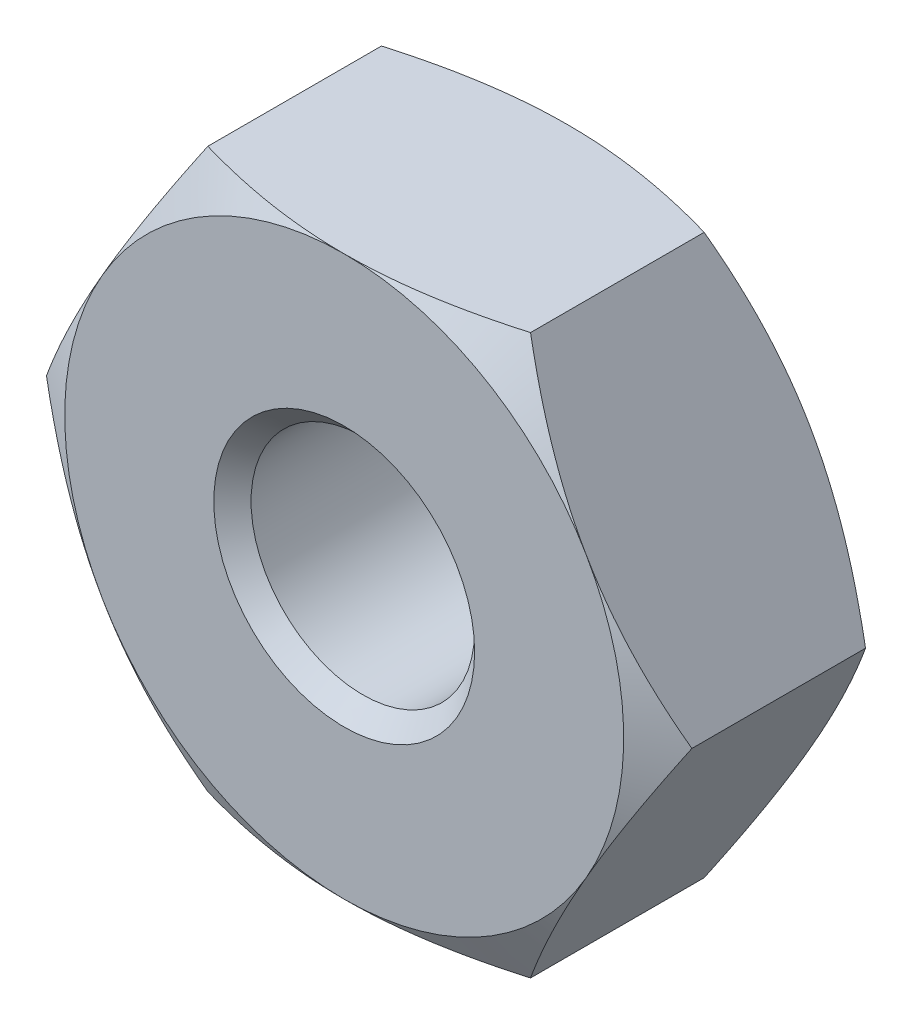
ISO-10303-21;
HEADER;
FILE_DESCRIPTION(('STEP AP214'),'2;1');
FILE_NAME('part.step','',(''),(''),'','','');
FILE_SCHEMA(('AUTOMOTIVE_DESIGN { 1 0 10303 214 1 1 1 1 }'));
ENDSEC;
DATA;
#1=APPLICATION_CONTEXT('core data for automotive mechanical design processes');
#2=APPLICATION_PROTOCOL_DEFINITION('international standard','automotive_design',2000,#1);
#3=PRODUCT_CONTEXT('',#1,'mechanical');
#4=PRODUCT('Part','Part','',(#3));
#5=PRODUCT_RELATED_PRODUCT_CATEGORY('part','',(#4));
#6=PRODUCT_DEFINITION_FORMATION('','',#4);
#7=PRODUCT_DEFINITION_CONTEXT('part definition',#1,'design');
#8=PRODUCT_DEFINITION('design','',#6,#7);
#9=PRODUCT_DEFINITION_SHAPE('','',#8);
#10=(LENGTH_UNIT() NAMED_UNIT(*) SI_UNIT(.MILLI.,.METRE.));
#11=(NAMED_UNIT(*) PLANE_ANGLE_UNIT() SI_UNIT($,.RADIAN.));
#12=(NAMED_UNIT(*) SI_UNIT($,.STERADIAN.) SOLID_ANGLE_UNIT());
#13=UNCERTAINTY_MEASURE_WITH_UNIT(LENGTH_MEASURE(1.E-05),#10,'distance_accuracy_value','');
#14=(GEOMETRIC_REPRESENTATION_CONTEXT(3) GLOBAL_UNCERTAINTY_ASSIGNED_CONTEXT((#13)) GLOBAL_UNIT_ASSIGNED_CONTEXT((#10,
#11,#12)) REPRESENTATION_CONTEXT('',''));
#15=CARTESIAN_POINT('',(0.,0.,0.));
#16=DIRECTION('',(0.,0.,1.));
#17=DIRECTION('',(1.,0.,0.));
#18=AXIS2_PLACEMENT_3D('',#15,#16,#17);
#19=CARTESIAN_POINT('',(-0.866025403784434,-1.5,-1.2));
#20=DIRECTION('',(0.,-1.,0.));
#21=DIRECTION('',(0.,0.,-1.));
#22=AXIS2_PLACEMENT_3D('',#19,#20,#21);
#23=PLANE('',#22);
#24=CARTESIAN_POINT('',(-2.29682699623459,-1.5,-0.717790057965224));
#25=CARTESIAN_POINT('',(-2.23096843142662,-1.5,-0.685963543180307));
#26=CARTESIAN_POINT('',(-2.16495427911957,-1.5,-0.654453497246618));
#27=CARTESIAN_POINT('',(-2.03253035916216,-1.5,-0.592246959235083));
#28=CARTESIAN_POINT('',(-1.9661205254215,-1.5,-0.561550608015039));
#29=CARTESIAN_POINT('',(-1.83246206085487,-1.5,-0.500990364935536));
#30=CARTESIAN_POINT('',(-1.76521080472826,-1.5,-0.47113224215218));
#31=CARTESIAN_POINT('',(-1.63015654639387,-1.5,-0.412699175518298));
#32=CARTESIAN_POINT('',(-1.56235357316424,-1.5,-0.384124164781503));
#33=CARTESIAN_POINT('',(-1.42524182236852,-1.5,-0.328255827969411));
#34=CARTESIAN_POINT('',(-1.35592477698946,-1.5,-0.30098253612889));
#35=CARTESIAN_POINT('',(-1.21648682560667,-1.5,-0.248581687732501));
#36=CARTESIAN_POINT('',(-1.14636582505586,-1.5,-0.223454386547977));
#37=CARTESIAN_POINT('',(-0.934888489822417,-1.5,-0.152281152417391));
#38=CARTESIAN_POINT('',(-0.792055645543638,-1.5,-0.110289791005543));
#39=CARTESIAN_POINT('',(-0.574716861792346,-1.5,-0.0606014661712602));
#40=CARTESIAN_POINT('',(-0.501740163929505,-1.5,-0.0462535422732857));
#41=CARTESIAN_POINT('',(-0.354902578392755,-1.5,-0.0229763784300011));
#42=CARTESIAN_POINT('',(-0.281041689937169,-1.5,-0.0140471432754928));
#43=CARTESIAN_POINT('',(-0.133293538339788,-1.5,-0.00239409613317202));
#44=CARTESIAN_POINT('',(-0.0594094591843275,-1.5,0.000369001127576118));
#45=CARTESIAN_POINT('',(0.0882997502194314,-1.5,-0.000449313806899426));
#46=CARTESIAN_POINT('',(0.162124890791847,-1.5,-0.00402907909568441));
#47=CARTESIAN_POINT('',(0.340722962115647,-1.5,-0.0200432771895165));
#48=CARTESIAN_POINT('',(0.445215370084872,-1.5,-0.035612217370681));
#49=CARTESIAN_POINT('',(0.652266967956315,-1.5,-0.0766496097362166));
#50=CARTESIAN_POINT('',(0.754823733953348,-1.5,-0.102129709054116));
#51=CARTESIAN_POINT('',(0.908315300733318,-1.5,-0.146069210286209));
#52=CARTESIAN_POINT('',(0.960034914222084,-1.5,-0.161892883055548));
#53=CARTESIAN_POINT('',(1.06293144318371,-1.5,-0.195106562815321));
#54=CARTESIAN_POINT('',(1.11410870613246,-1.5,-0.212495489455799));
#55=CARTESIAN_POINT('',(1.21571016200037,-1.5,-0.248477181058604));
#56=CARTESIAN_POINT('',(1.2661369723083,-1.5,-0.267062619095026));
#57=CARTESIAN_POINT('',(1.36659934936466,-1.5,-0.305324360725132));
#58=CARTESIAN_POINT('',(1.416634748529,-1.5,-0.325001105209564));
#59=CARTESIAN_POINT('',(1.4664888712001,-1.5,-0.345115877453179));
#60=B_SPLINE_CURVE_WITH_KNOTS('',3,(#24,#25,#26,#27,#28,#29,#30,#31,#32,#33,#34,#35,#36,#37,#38,
#39,#40,#41,#42,#43,#44,#45,#46,#47,#48,#49,#50,#51,#52,#53,#54,#55,#56,#57,#58,#59),
.UNSPECIFIED.,.F.,.F.,(4,2,2,2,2,2,2,2,2,2,2,2,2,2,2,2,2,4),(0.,0.219439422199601,
0.438916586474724,0.659649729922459,0.880371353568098,1.10380188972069,1.3272589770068,
1.77299403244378,1.99595442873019,2.21891502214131,2.4404509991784,2.66192946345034,
2.97821851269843,3.29488037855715,3.45711959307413,3.61924767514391,3.78046319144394,
3.94174432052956),.UNSPECIFIED.);
#61=CARTESIAN_POINT('',(-0.866025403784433,-1.5,-0.133974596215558));
#62=VERTEX_POINT('',#61);
#63=CARTESIAN_POINT('',(0.,-1.5,0.));
#64=VERTEX_POINT('',#63);
#65=EDGE_CURVE('E51',#62,#64,#60,.T.);
#66=ORIENTED_EDGE('',*,*,#65,.F.);
#67=DIRECTION('',(0.,0.,1.));
#68=VECTOR('',#67,1.);
#69=CARTESIAN_POINT('',(-0.866025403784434,-1.5,-1.2));
#70=LINE('',#69,#68);
#71=CARTESIAN_POINT('',(-0.866025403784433,-1.5,-1.06602540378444));
#72=VERTEX_POINT('',#71);
#73=EDGE_CURVE('E164',#72,#62,#70,.T.);
#74=ORIENTED_EDGE('',*,*,#73,.F.);
#75=CARTESIAN_POINT('',(-2.29682699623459,-1.5,-0.482209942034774));
#76=CARTESIAN_POINT('',(-2.23096843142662,-1.5,-0.514036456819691));
#77=CARTESIAN_POINT('',(-2.16495427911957,-1.5,-0.54554650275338));
#78=CARTESIAN_POINT('',(-2.03253035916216,-1.5,-0.607753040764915));
#79=CARTESIAN_POINT('',(-1.9661205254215,-1.5,-0.63844939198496));
#80=CARTESIAN_POINT('',(-1.83246206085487,-1.5,-0.699009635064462));
#81=CARTESIAN_POINT('',(-1.76521080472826,-1.5,-0.728867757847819));
#82=CARTESIAN_POINT('',(-1.63015654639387,-1.5,-0.787300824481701));
#83=CARTESIAN_POINT('',(-1.56235357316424,-1.5,-0.815875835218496));
#84=CARTESIAN_POINT('',(-1.42524182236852,-1.5,-0.871744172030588));
#85=CARTESIAN_POINT('',(-1.35592477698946,-1.5,-0.899017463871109));
#86=CARTESIAN_POINT('',(-1.21648682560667,-1.5,-0.951418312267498));
#87=CARTESIAN_POINT('',(-1.14636582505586,-1.5,-0.976545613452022));
#88=CARTESIAN_POINT('',(-0.934888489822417,-1.5,-1.04771884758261));
#89=CARTESIAN_POINT('',(-0.792055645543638,-1.5,-1.08971020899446));
#90=CARTESIAN_POINT('',(-0.574716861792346,-1.5,-1.13939853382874));
#91=CARTESIAN_POINT('',(-0.501740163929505,-1.5,-1.15374645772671));
#92=CARTESIAN_POINT('',(-0.354902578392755,-1.5,-1.17702362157));
#93=CARTESIAN_POINT('',(-0.281041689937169,-1.5,-1.18595285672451));
#94=CARTESIAN_POINT('',(-0.133293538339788,-1.5,-1.19760590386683));
#95=CARTESIAN_POINT('',(-0.0594094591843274,-1.5,-1.20036900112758));
#96=CARTESIAN_POINT('',(0.0882997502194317,-1.5,-1.1995506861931));
#97=CARTESIAN_POINT('',(0.162124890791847,-1.5,-1.19597092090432));
#98=CARTESIAN_POINT('',(0.340722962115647,-1.5,-1.17995672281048));
#99=CARTESIAN_POINT('',(0.445215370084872,-1.5,-1.16438778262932));
#100=CARTESIAN_POINT('',(0.652266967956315,-1.5,-1.12335039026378));
#101=CARTESIAN_POINT('',(0.754823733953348,-1.5,-1.09787029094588));
#102=CARTESIAN_POINT('',(0.908315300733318,-1.5,-1.05393078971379));
#103=CARTESIAN_POINT('',(0.960034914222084,-1.5,-1.03810711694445));
#104=CARTESIAN_POINT('',(1.06293144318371,-1.5,-1.00489343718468));
#105=CARTESIAN_POINT('',(1.11410870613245,-1.5,-0.987504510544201));
#106=CARTESIAN_POINT('',(1.21571016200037,-1.5,-0.951522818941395));
#107=CARTESIAN_POINT('',(1.26613697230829,-1.5,-0.932937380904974));
#108=CARTESIAN_POINT('',(1.36659934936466,-1.5,-0.894675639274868));
#109=CARTESIAN_POINT('',(1.416634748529,-1.5,-0.874998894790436));
#110=CARTESIAN_POINT('',(1.46648887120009,-1.5,-0.854884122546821));
#111=B_SPLINE_CURVE_WITH_KNOTS('',3,(#75,#76,#77,#78,#79,#80,#81,#82,#83,#84,#85,#86,#87,#88,
#89,#90,#91,#92,#93,#94,#95,#96,#97,#98,#99,#100,#101,#102,#103,#104,#105,#106,#107,#108,#109,
#110),.UNSPECIFIED.,.F.,.F.,(4,2,2,2,2,2,2,2,2,2,2,2,2,2,2,2,2,4),(0.,0.219439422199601,
0.438916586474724,0.659649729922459,0.880371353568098,1.10380188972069,1.3272589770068,
1.77299403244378,1.99595442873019,2.21891502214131,2.4404509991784,2.66192946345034,
2.97821851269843,3.29488037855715,3.45711959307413,3.61924767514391,3.78046319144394,
3.94174432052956),.UNSPECIFIED.);
#112=CARTESIAN_POINT('',(0.,-1.5,-1.2));
#113=VERTEX_POINT('',#112);
#114=EDGE_CURVE('E321',#113,#72,#111,.F.);
#115=ORIENTED_EDGE('',*,*,#114,.F.);
#116=CARTESIAN_POINT('',(0.866025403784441,-1.5,-1.06602540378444));
#117=VERTEX_POINT('',#116);
#118=EDGE_CURVE('E159',#117,#113,#111,.F.);
#119=ORIENTED_EDGE('',*,*,#118,.F.);
#120=DIRECTION('',(0.,0.,1.));
#121=VECTOR('',#120,1.);
#122=CARTESIAN_POINT('',(0.866025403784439,-1.5,-1.2));
#123=LINE('',#122,#121);
#124=CARTESIAN_POINT('',(0.866025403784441,-1.5,-0.133974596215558));
#125=VERTEX_POINT('',#124);
#126=EDGE_CURVE('E154',#117,#125,#123,.T.);
#127=ORIENTED_EDGE('',*,*,#126,.T.);
#128=EDGE_CURVE('E146',#64,#125,#60,.T.);
#129=ORIENTED_EDGE('',*,*,#128,.F.);
#130=EDGE_LOOP('',(#66,#74,#115,#119,#127,#129));
#131=FACE_BOUND('',#130,.T.);
#132=ADVANCED_FACE('F35',(#131),#23,.T.);
#133=CARTESIAN_POINT('',(-1.73205080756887,0.,-1.2));
#134=DIRECTION('',(-0.866025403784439,-0.5,0.));
#135=DIRECTION('',(0.5,-0.866025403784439,0.));
#136=AXIS2_PLACEMENT_3D('',#133,#134,#135);
#137=PLANE('',#136);
#138=CARTESIAN_POINT('',(-1.73216627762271,0.000199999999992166,-0.134041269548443));
#139=CARTESIAN_POINT('',(-1.69410775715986,-0.065719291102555,-0.112057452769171));
#140=CARTESIAN_POINT('',(-1.65572072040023,-0.132207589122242,-0.092063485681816));
#141=CARTESIAN_POINT('',(-1.57828184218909,-0.266335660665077,-0.0571626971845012));
#142=CARTESIAN_POINT('',(-1.53922862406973,-0.333977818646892,-0.0422682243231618));
#143=CARTESIAN_POINT('',(-1.46160621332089,-0.468423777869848,-0.0190812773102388));
#144=CARTESIAN_POINT('',(-1.42304896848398,-0.535206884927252,-0.0106345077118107));
#145=CARTESIAN_POINT('',(-1.34575291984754,-0.669087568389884,-0.000548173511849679));
#146=CARTESIAN_POINT('',(-1.30701439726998,-0.736184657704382,0.00109974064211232));
#147=CARTESIAN_POINT('',(-1.23462040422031,-0.861574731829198,-0.00231621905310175));
#148=CARTESIAN_POINT('',(-1.20095413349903,-0.919886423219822,-0.00654135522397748));
#149=CARTESIAN_POINT('',(-1.13384094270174,-1.03612987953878,-0.0199363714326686));
#150=CARTESIAN_POINT('',(-1.10039425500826,-1.09406124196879,-0.0291108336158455));
#151=CARTESIAN_POINT('',(-1.03314252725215,-1.21054465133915,-0.0520477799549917));
#152=CARTESIAN_POINT('',(-0.999346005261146,-1.26908194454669,-0.0659075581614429));
#153=CARTESIAN_POINT('',(-0.932257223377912,-1.38528312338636,-0.0973643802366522));
#154=CARTESIAN_POINT('',(-0.898964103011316,-1.44294849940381,-0.114954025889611));
#155=CARTESIAN_POINT('',(-0.865909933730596,-1.5002,-0.134041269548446));
#156=B_SPLINE_CURVE_WITH_KNOTS('',3,(#138,#139,#140,#141,#142,#143,#144,#145,#146,#147,#148,
#149,#150,#151,#152,#153,#154,#155),.UNSPECIFIED.,.F.,.F.,(4,2,2,2,2,2,2,2,4),(0.,
0.237777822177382,0.476127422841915,0.708577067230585,0.940741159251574,1.1429435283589,
1.34533342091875,1.55221450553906,1.75868901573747),.UNSPECIFIED.);
#157=CARTESIAN_POINT('',(-1.73205080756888,0.,-0.133974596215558));
#158=VERTEX_POINT('',#157);
#159=CARTESIAN_POINT('',(-1.29903810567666,-0.75,0.));
#160=VERTEX_POINT('',#159);
#161=EDGE_CURVE('E58',#158,#160,#156,.T.);
#162=ORIENTED_EDGE('',*,*,#161,.F.);
#163=DIRECTION('',(0.,0.,1.));
#164=VECTOR('',#163,1.);
#165=CARTESIAN_POINT('',(-1.73205080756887,0.,-1.2));
#166=LINE('',#165,#164);
#167=CARTESIAN_POINT('',(-1.73205080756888,0.,-1.06602540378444));
#168=VERTEX_POINT('',#167);
#169=EDGE_CURVE('E173',#168,#158,#166,.T.);
#170=ORIENTED_EDGE('',*,*,#169,.F.);
#171=CARTESIAN_POINT('',(-0.865909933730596,-1.5002,-1.06595873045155));
#172=CARTESIAN_POINT('',(-0.903968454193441,-1.43428070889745,-1.08794254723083));
#173=CARTESIAN_POINT('',(-0.942355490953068,-1.36779241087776,-1.10793651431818));
#174=CARTESIAN_POINT('',(-1.01979436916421,-1.23366433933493,-1.1428373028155));
#175=CARTESIAN_POINT('',(-1.05884758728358,-1.16602218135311,-1.15773177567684));
#176=CARTESIAN_POINT('',(-1.13646999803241,-1.03157622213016,-1.18091872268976));
#177=CARTESIAN_POINT('',(-1.17502724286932,-0.964793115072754,-1.18936549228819));
#178=CARTESIAN_POINT('',(-1.25232329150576,-0.830912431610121,-1.19945182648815));
#179=CARTESIAN_POINT('',(-1.29106181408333,-0.763815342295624,-1.20109974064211));
#180=CARTESIAN_POINT('',(-1.363455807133,-0.638425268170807,-1.1976837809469));
#181=CARTESIAN_POINT('',(-1.39712207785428,-0.580113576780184,-1.19345864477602));
#182=CARTESIAN_POINT('',(-1.46423526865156,-0.463870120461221,-1.18006362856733));
#183=CARTESIAN_POINT('',(-1.49768195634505,-0.405938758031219,-1.17088916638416));
#184=CARTESIAN_POINT('',(-1.56493368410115,-0.289455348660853,-1.14795222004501));
#185=CARTESIAN_POINT('',(-1.59873020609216,-0.230918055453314,-1.13409244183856));
#186=CARTESIAN_POINT('',(-1.66581898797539,-0.114716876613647,-1.10263561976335));
#187=CARTESIAN_POINT('',(-1.69911210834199,-0.0570515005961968,-1.08504597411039));
#188=CARTESIAN_POINT('',(-1.73216627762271,0.000199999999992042,-1.06595873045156));
#189=B_SPLINE_CURVE_WITH_KNOTS('',3,(#171,#172,#173,#174,#175,#176,#177,#178,#179,#180,#181,
#182,#183,#184,#185,#186,#187,#188),.UNSPECIFIED.,.F.,.F.,(4,2,2,2,2,2,2,2,4),(0.,
0.237777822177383,0.476127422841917,0.708577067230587,0.940741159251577,1.1429435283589,
1.34533342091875,1.55221450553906,1.75868901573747),.UNSPECIFIED.);
#190=CARTESIAN_POINT('',(-1.29903810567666,-0.75,-1.2));
#191=VERTEX_POINT('',#190);
#192=EDGE_CURVE('E203',#191,#168,#189,.T.);
#193=ORIENTED_EDGE('',*,*,#192,.F.);
#194=EDGE_CURVE('E319',#72,#191,#189,.T.);
#195=ORIENTED_EDGE('',*,*,#194,.F.);
#196=ORIENTED_EDGE('',*,*,#73,.T.);
#197=EDGE_CURVE('E284',#160,#62,#156,.T.);
#198=ORIENTED_EDGE('',*,*,#197,.F.);
#199=EDGE_LOOP('',(#162,#170,#193,#195,#196,#198));
#200=FACE_BOUND('',#199,.T.);
#201=ADVANCED_FACE('F296',(#200),#137,.T.);
#202=CARTESIAN_POINT('',(-0.866025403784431,1.49999999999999,-1.2));
#203=DIRECTION('',(-0.866025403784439,0.5,0.));
#204=DIRECTION('',(-0.5,-0.866025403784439,0.));
#205=AXIS2_PLACEMENT_3D('',#202,#203,#204);
#206=PLANE('',#205);
#207=CARTESIAN_POINT('',(-0.865909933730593,1.50019999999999,-0.134041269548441));
#208=CARTESIAN_POINT('',(-0.903968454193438,1.43428070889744,-0.112057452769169));
#209=CARTESIAN_POINT('',(-0.942355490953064,1.36779241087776,-0.0920634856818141));
#210=CARTESIAN_POINT('',(-1.0197943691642,1.23366433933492,-0.0571626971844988));
#211=CARTESIAN_POINT('',(-1.05884758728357,1.16602218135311,-0.0422682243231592));
#212=CARTESIAN_POINT('',(-1.1364699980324,1.03157622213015,-0.0190812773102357));
#213=CARTESIAN_POINT('',(-1.17502724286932,0.964793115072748,-0.0106345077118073));
#214=CARTESIAN_POINT('',(-1.25232329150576,0.830912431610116,-0.000548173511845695));
#215=CARTESIAN_POINT('',(-1.29106181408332,0.763815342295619,0.00109974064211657));
#216=CARTESIAN_POINT('',(-1.36345580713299,0.638425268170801,-0.0023162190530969));
#217=CARTESIAN_POINT('',(-1.39712207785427,0.580113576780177,-0.00654135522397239));
#218=CARTESIAN_POINT('',(-1.46423526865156,0.463870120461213,-0.0199363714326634));
#219=CARTESIAN_POINT('',(-1.49768195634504,0.405938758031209,-0.0291108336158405));
#220=CARTESIAN_POINT('',(-1.56493368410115,0.289455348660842,-0.052047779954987));
#221=CARTESIAN_POINT('',(-1.59873020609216,0.230918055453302,-0.0659075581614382));
#222=CARTESIAN_POINT('',(-1.66581898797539,0.114716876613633,-0.097364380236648));
#223=CARTESIAN_POINT('',(-1.69911210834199,0.0570515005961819,-0.114954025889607));
#224=CARTESIAN_POINT('',(-1.73216627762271,-0.000200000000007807,-0.134041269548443));
#225=B_SPLINE_CURVE_WITH_KNOTS('',3,(#207,#208,#209,#210,#211,#212,#213,#214,#215,#216,#217,
#218,#219,#220,#221,#222,#223,#224),.UNSPECIFIED.,.F.,.F.,(4,2,2,2,2,2,2,2,4),(0.,
0.237777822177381,0.476127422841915,0.708577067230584,0.940741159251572,1.1429435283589,
1.34533342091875,1.55221450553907,1.75868901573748),.UNSPECIFIED.);
#226=CARTESIAN_POINT('',(-0.866025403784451,1.49999999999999,-0.133974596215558));
#227=VERTEX_POINT('',#226);
#228=CARTESIAN_POINT('',(-1.29903810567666,0.75,0.));
#229=VERTEX_POINT('',#228);
#230=EDGE_CURVE('E329',#227,#229,#225,.T.);
#231=ORIENTED_EDGE('',*,*,#230,.F.);
#232=DIRECTION('',(0.,0.,1.));
#233=VECTOR('',#232,1.);
#234=CARTESIAN_POINT('',(-0.866025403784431,1.49999999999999,-1.2));
#235=LINE('',#234,#233);
#236=CARTESIAN_POINT('',(-0.866025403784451,1.49999999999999,-1.06602540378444));
#237=VERTEX_POINT('',#236);
#238=EDGE_CURVE('E156',#237,#227,#235,.T.);
#239=ORIENTED_EDGE('',*,*,#238,.F.);
#240=CARTESIAN_POINT('',(-1.73216627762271,-0.00020000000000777,-1.06595873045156));
#241=CARTESIAN_POINT('',(-1.69410775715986,0.0657192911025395,-1.08794254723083));
#242=CARTESIAN_POINT('',(-1.65572072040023,0.132207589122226,-1.10793651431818));
#243=CARTESIAN_POINT('',(-1.57828184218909,0.266335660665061,-1.1428373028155));
#244=CARTESIAN_POINT('',(-1.53922862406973,0.333977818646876,-1.15773177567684));
#245=CARTESIAN_POINT('',(-1.46160621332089,0.468423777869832,-1.18091872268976));
#246=CARTESIAN_POINT('',(-1.42304896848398,0.535206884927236,-1.18936549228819));
#247=CARTESIAN_POINT('',(-1.34575291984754,0.669087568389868,-1.19945182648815));
#248=CARTESIAN_POINT('',(-1.30701439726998,0.736184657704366,-1.20109974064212));
#249=CARTESIAN_POINT('',(-1.23462040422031,0.861574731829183,-1.1976837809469));
#250=CARTESIAN_POINT('',(-1.20095413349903,0.919886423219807,-1.19345864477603));
#251=CARTESIAN_POINT('',(-1.13384094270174,1.03612987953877,-1.18006362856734));
#252=CARTESIAN_POINT('',(-1.10039425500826,1.09406124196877,-1.17088916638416));
#253=CARTESIAN_POINT('',(-1.03314252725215,1.21054465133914,-1.14795222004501));
#254=CARTESIAN_POINT('',(-0.999346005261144,1.26908194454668,-1.13409244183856));
#255=CARTESIAN_POINT('',(-0.932257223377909,1.38528312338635,-1.10263561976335));
#256=CARTESIAN_POINT('',(-0.898964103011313,1.4429484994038,-1.08504597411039));
#257=CARTESIAN_POINT('',(-0.865909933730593,1.50019999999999,-1.06595873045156));
#258=B_SPLINE_CURVE_WITH_KNOTS('',3,(#240,#241,#242,#243,#244,#245,#246,#247,#248,#249,#250,
#251,#252,#253,#254,#255,#256,#257),.UNSPECIFIED.,.F.,.F.,(4,2,2,2,2,2,2,2,4),(0.,
0.237777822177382,0.476127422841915,0.708577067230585,0.940741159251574,1.1429435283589,
1.34533342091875,1.55221450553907,1.75868901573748),.UNSPECIFIED.);
#259=CARTESIAN_POINT('',(-1.29903810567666,0.75,-1.2));
#260=VERTEX_POINT('',#259);
#261=EDGE_CURVE('E192',#260,#237,#258,.T.);
#262=ORIENTED_EDGE('',*,*,#261,.F.);
#263=EDGE_CURVE('E196',#168,#260,#258,.T.);
#264=ORIENTED_EDGE('',*,*,#263,.F.);
#265=ORIENTED_EDGE('',*,*,#169,.T.);
#266=EDGE_CURVE('E291',#229,#158,#225,.T.);
#267=ORIENTED_EDGE('',*,*,#266,.F.);
#268=EDGE_LOOP('',(#231,#239,#262,#264,#265,#267));
#269=FACE_BOUND('',#268,.T.);
#270=ADVANCED_FACE('F194',(#269),#206,.T.);
#271=CARTESIAN_POINT('',(0.866025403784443,1.49999999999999,-1.2));
#272=DIRECTION('',(0.,1.,0.));
#273=DIRECTION('',(0.,0.,1.));
#274=AXIS2_PLACEMENT_3D('',#271,#272,#273);
#275=PLANE('',#274);
#276=CARTESIAN_POINT('',(-2.29682699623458,1.49999999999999,-0.717790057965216));
#277=CARTESIAN_POINT('',(-2.23096843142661,1.49999999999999,-0.6859635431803));
#278=CARTESIAN_POINT('',(-2.16495427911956,1.49999999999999,-0.654453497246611));
#279=CARTESIAN_POINT('',(-2.03253035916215,1.49999999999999,-0.592246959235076));
#280=CARTESIAN_POINT('',(-1.96612052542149,1.49999999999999,-0.561550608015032));
#281=CARTESIAN_POINT('',(-1.83246206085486,1.49999999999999,-0.500990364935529));
#282=CARTESIAN_POINT('',(-1.76521080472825,1.49999999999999,-0.471132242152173));
#283=CARTESIAN_POINT('',(-1.63015654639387,1.49999999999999,-0.412699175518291));
#284=CARTESIAN_POINT('',(-1.56235357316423,1.49999999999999,-0.384124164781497));
#285=CARTESIAN_POINT('',(-1.42524182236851,1.49999999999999,-0.328255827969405));
#286=CARTESIAN_POINT('',(-1.35592477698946,1.49999999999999,-0.300982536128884));
#287=CARTESIAN_POINT('',(-1.21648682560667,1.49999999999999,-0.248581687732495));
#288=CARTESIAN_POINT('',(-1.14636582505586,1.49999999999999,-0.223454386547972));
#289=CARTESIAN_POINT('',(-0.934888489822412,1.49999999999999,-0.152281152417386));
#290=CARTESIAN_POINT('',(-0.792055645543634,1.49999999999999,-0.110289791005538));
#291=CARTESIAN_POINT('',(-0.574716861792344,1.49999999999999,-0.0606014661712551));
#292=CARTESIAN_POINT('',(-0.501740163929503,1.49999999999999,-0.0462535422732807));
#293=CARTESIAN_POINT('',(-0.354902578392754,1.49999999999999,-0.0229763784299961));
#294=CARTESIAN_POINT('',(-0.281041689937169,1.49999999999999,-0.0140471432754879));
#295=CARTESIAN_POINT('',(-0.133293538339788,1.49999999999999,-0.00239409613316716));
#296=CARTESIAN_POINT('',(-0.0594094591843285,1.49999999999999,0.000369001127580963));
#297=CARTESIAN_POINT('',(0.0882997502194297,1.49999999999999,-0.000449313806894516));
#298=CARTESIAN_POINT('',(0.162124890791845,1.49999999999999,-0.0040290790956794));
#299=CARTESIAN_POINT('',(0.340722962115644,1.49999999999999,-0.0200432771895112));
#300=CARTESIAN_POINT('',(0.445215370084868,1.49999999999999,-0.0356122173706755));
#301=CARTESIAN_POINT('',(0.65226696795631,1.49999999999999,-0.0766496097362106));
#302=CARTESIAN_POINT('',(0.754823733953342,1.49999999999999,-0.10212970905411));
#303=CARTESIAN_POINT('',(0.908315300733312,1.49999999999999,-0.146069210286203));
#304=CARTESIAN_POINT('',(0.960034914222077,1.49999999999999,-0.161892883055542));
#305=CARTESIAN_POINT('',(1.0629314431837,1.49999999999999,-0.195106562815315));
#306=CARTESIAN_POINT('',(1.11410870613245,1.49999999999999,-0.212495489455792));
#307=CARTESIAN_POINT('',(1.21571016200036,1.49999999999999,-0.248477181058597));
#308=CARTESIAN_POINT('',(1.26613697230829,1.49999999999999,-0.267062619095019));
#309=CARTESIAN_POINT('',(1.36659934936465,1.49999999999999,-0.305324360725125));
#310=CARTESIAN_POINT('',(1.41663474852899,1.49999999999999,-0.325001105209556));
#311=CARTESIAN_POINT('',(1.46648887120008,1.49999999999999,-0.345115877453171));
#312=B_SPLINE_CURVE_WITH_KNOTS('',3,(#276,#277,#278,#279,#280,#281,#282,#283,#284,#285,#286,
#287,#288,#289,#290,#291,#292,#293,#294,#295,#296,#297,#298,#299,#300,#301,#302,#303,#304,#305,
#306,#307,#308,#309,#310,#311),.UNSPECIFIED.,.F.,.F.,(4,2,2,2,2,2,2,2,2,2,2,2,2,2,2,2,2,4),(0.,
0.2194394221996,0.438916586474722,0.659649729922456,0.880371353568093,1.10380188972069,
1.3272589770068,1.77299403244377,1.99595442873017,2.2189150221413,2.44045099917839,
2.66192946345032,2.97821851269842,3.29488037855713,3.45711959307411,3.61924767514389,
3.78046319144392,3.94174432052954),.UNSPECIFIED.);
#313=CARTESIAN_POINT('',(0.866025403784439,1.5,-0.133974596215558));
#314=VERTEX_POINT('',#313);
#315=CARTESIAN_POINT('',(0.,1.5,0.));
#316=VERTEX_POINT('',#315);
#317=EDGE_CURVE('E278',#314,#316,#312,.F.);
#318=ORIENTED_EDGE('',*,*,#317,.F.);
#319=DIRECTION('',(0.,0.,1.));
#320=VECTOR('',#319,1.);
#321=CARTESIAN_POINT('',(0.866025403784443,1.49999999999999,-1.2));
#322=LINE('',#321,#320);
#323=CARTESIAN_POINT('',(0.866025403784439,1.5,-1.06602540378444));
#324=VERTEX_POINT('',#323);
#325=EDGE_CURVE('E153',#324,#314,#322,.T.);
#326=ORIENTED_EDGE('',*,*,#325,.F.);
#327=CARTESIAN_POINT('',(-2.29682699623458,1.49999999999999,-0.482209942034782));
#328=CARTESIAN_POINT('',(-2.23096843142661,1.49999999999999,-0.514036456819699));
#329=CARTESIAN_POINT('',(-2.16495427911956,1.49999999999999,-0.545546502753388));
#330=CARTESIAN_POINT('',(-2.03253035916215,1.49999999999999,-0.607753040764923));
#331=CARTESIAN_POINT('',(-1.96612052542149,1.49999999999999,-0.638449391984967));
#332=CARTESIAN_POINT('',(-1.83246206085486,1.49999999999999,-0.699009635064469));
#333=CARTESIAN_POINT('',(-1.76521080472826,1.49999999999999,-0.728867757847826));
#334=CARTESIAN_POINT('',(-1.63015654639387,1.49999999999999,-0.787300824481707));
#335=CARTESIAN_POINT('',(-1.56235357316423,1.49999999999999,-0.815875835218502));
#336=CARTESIAN_POINT('',(-1.42524182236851,1.49999999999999,-0.871744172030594));
#337=CARTESIAN_POINT('',(-1.35592477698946,1.49999999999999,-0.899017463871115));
#338=CARTESIAN_POINT('',(-1.21648682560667,1.49999999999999,-0.951418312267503));
#339=CARTESIAN_POINT('',(-1.14636582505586,1.49999999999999,-0.976545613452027));
#340=CARTESIAN_POINT('',(-0.934888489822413,1.49999999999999,-1.04771884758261));
#341=CARTESIAN_POINT('',(-0.792055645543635,1.49999999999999,-1.08971020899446));
#342=CARTESIAN_POINT('',(-0.574716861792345,1.49999999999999,-1.13939853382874));
#343=CARTESIAN_POINT('',(-0.501740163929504,1.49999999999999,-1.15374645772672));
#344=CARTESIAN_POINT('',(-0.354902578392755,1.49999999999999,-1.17702362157));
#345=CARTESIAN_POINT('',(-0.281041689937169,1.49999999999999,-1.18595285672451));
#346=CARTESIAN_POINT('',(-0.133293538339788,1.49999999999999,-1.19760590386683));
#347=CARTESIAN_POINT('',(-0.0594094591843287,1.49999999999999,-1.20036900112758));
#348=CARTESIAN_POINT('',(0.0882997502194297,1.49999999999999,-1.19955068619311));
#349=CARTESIAN_POINT('',(0.162124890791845,1.49999999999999,-1.19597092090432));
#350=CARTESIAN_POINT('',(0.340722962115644,1.49999999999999,-1.17995672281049));
#351=CARTESIAN_POINT('',(0.445215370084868,1.49999999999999,-1.16438778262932));
#352=CARTESIAN_POINT('',(0.652266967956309,1.49999999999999,-1.12335039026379));
#353=CARTESIAN_POINT('',(0.754823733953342,1.49999999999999,-1.09787029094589));
#354=CARTESIAN_POINT('',(0.908315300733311,1.49999999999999,-1.0539307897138));
#355=CARTESIAN_POINT('',(0.960034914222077,1.49999999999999,-1.03810711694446));
#356=CARTESIAN_POINT('',(1.0629314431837,1.49999999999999,-1.00489343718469));
#357=CARTESIAN_POINT('',(1.11410870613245,1.49999999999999,-0.987504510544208));
#358=CARTESIAN_POINT('',(1.21571016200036,1.49999999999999,-0.951522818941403));
#359=CARTESIAN_POINT('',(1.26613697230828,1.49999999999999,-0.932937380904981));
#360=CARTESIAN_POINT('',(1.36659934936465,1.49999999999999,-0.894675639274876));
#361=CARTESIAN_POINT('',(1.41663474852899,1.49999999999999,-0.874998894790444));
#362=CARTESIAN_POINT('',(1.46648887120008,1.49999999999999,-0.854884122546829));
#363=B_SPLINE_CURVE_WITH_KNOTS('',3,(#327,#328,#329,#330,#331,#332,#333,#334,#335,#336,#337,
#338,#339,#340,#341,#342,#343,#344,#345,#346,#347,#348,#349,#350,#351,#352,#353,#354,#355,#356,
#357,#358,#359,#360,#361,#362),.UNSPECIFIED.,.F.,.F.,(4,2,2,2,2,2,2,2,2,2,2,2,2,2,2,2,2,4),(0.,
0.2194394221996,0.438916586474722,0.659649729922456,0.880371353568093,1.10380188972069,
1.3272589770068,1.77299403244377,1.99595442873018,2.2189150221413,2.44045099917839,
2.66192946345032,2.97821851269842,3.29488037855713,3.45711959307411,3.61924767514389,
3.78046319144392,3.94174432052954),.UNSPECIFIED.);
#364=CARTESIAN_POINT('',(0.,1.5,-1.2));
#365=VERTEX_POINT('',#364);
#366=EDGE_CURVE('E204',#365,#324,#363,.T.);
#367=ORIENTED_EDGE('',*,*,#366,.F.);
#368=EDGE_CURVE('E201',#237,#365,#363,.T.);
#369=ORIENTED_EDGE('',*,*,#368,.F.);
#370=ORIENTED_EDGE('',*,*,#238,.T.);
#371=EDGE_CURVE('E285',#316,#227,#312,.F.);
#372=ORIENTED_EDGE('',*,*,#371,.F.);
#373=EDGE_LOOP('',(#318,#326,#367,#369,#370,#372));
#374=FACE_BOUND('',#373,.T.);
#375=ADVANCED_FACE('F259',(#374),#275,.T.);
#376=CARTESIAN_POINT('',(1.73205080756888,0.,-1.2));
#377=DIRECTION('',(0.866025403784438,0.500000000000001,0.));
#378=DIRECTION('',(-0.500000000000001,0.866025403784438,0.));
#379=AXIS2_PLACEMENT_3D('',#376,#377,#378);
#380=PLANE('',#379);
#381=CARTESIAN_POINT('',(1.73216627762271,-0.000199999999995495,-0.134041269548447));
#382=CARTESIAN_POINT('',(1.69410775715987,0.0657192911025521,-0.112057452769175));
#383=CARTESIAN_POINT('',(1.65572072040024,0.132207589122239,-0.0920634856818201));
#384=CARTESIAN_POINT('',(1.5782818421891,0.266335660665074,-0.0571626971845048));
#385=CARTESIAN_POINT('',(1.53922862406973,0.33397781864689,-0.0422682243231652));
#386=CARTESIAN_POINT('',(1.4616062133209,0.468423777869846,-0.0190812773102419));
#387=CARTESIAN_POINT('',(1.42304896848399,0.535206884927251,-0.0106345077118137));
#388=CARTESIAN_POINT('',(1.34575291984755,0.669087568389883,-0.000548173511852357));
#389=CARTESIAN_POINT('',(1.30701439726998,0.736184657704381,0.00109974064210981));
#390=CARTESIAN_POINT('',(1.23462040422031,0.861574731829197,-0.00231621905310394));
#391=CARTESIAN_POINT('',(1.20095413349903,0.91988642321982,-0.00654135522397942));
#392=CARTESIAN_POINT('',(1.13384094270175,1.03612987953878,-0.01993637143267));
#393=CARTESIAN_POINT('',(1.10039425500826,1.09406124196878,-0.0291108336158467));
#394=CARTESIAN_POINT('',(1.03314252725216,1.21054465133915,-0.0520477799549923));
#395=CARTESIAN_POINT('',(0.999346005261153,1.26908194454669,-0.0659075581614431));
#396=CARTESIAN_POINT('',(0.93225722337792,1.38528312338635,-0.0973643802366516));
#397=CARTESIAN_POINT('',(0.898964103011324,1.4429484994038,-0.11495402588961));
#398=CARTESIAN_POINT('',(0.865909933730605,1.50019999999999,-0.134041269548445));
#399=B_SPLINE_CURVE_WITH_KNOTS('',3,(#381,#382,#383,#384,#385,#386,#387,#388,#389,#390,#391,
#392,#393,#394,#395,#396,#397,#398),.UNSPECIFIED.,.F.,.F.,(4,2,2,2,2,2,2,2,4),(0.,
0.237777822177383,0.476127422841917,0.708577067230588,0.940741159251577,1.1429435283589,
1.34533342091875,1.55221450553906,1.75868901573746),.UNSPECIFIED.);
#400=CARTESIAN_POINT('',(1.73205080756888,0.,-0.133974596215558));
#401=VERTEX_POINT('',#400);
#402=CARTESIAN_POINT('',(1.29903810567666,0.750000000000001,0.));
#403=VERTEX_POINT('',#402);
#404=EDGE_CURVE('E129',#401,#403,#399,.T.);
#405=ORIENTED_EDGE('',*,*,#404,.F.);
#406=DIRECTION('',(0.,0.,1.));
#407=VECTOR('',#406,1.);
#408=CARTESIAN_POINT('',(1.73205080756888,0.,-1.2));
#409=LINE('',#408,#407);
#410=CARTESIAN_POINT('',(1.73205080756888,0.,-1.06602540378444));
#411=VERTEX_POINT('',#410);
#412=EDGE_CURVE('E143',#411,#401,#409,.T.);
#413=ORIENTED_EDGE('',*,*,#412,.F.);
#414=CARTESIAN_POINT('',(0.865909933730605,1.50019999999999,-1.06595873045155));
#415=CARTESIAN_POINT('',(0.90396845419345,1.43428070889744,-1.08794254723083));
#416=CARTESIAN_POINT('',(0.942355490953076,1.36779241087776,-1.10793651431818));
#417=CARTESIAN_POINT('',(1.01979436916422,1.23366433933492,-1.1428373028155));
#418=CARTESIAN_POINT('',(1.05884758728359,1.16602218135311,-1.15773177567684));
#419=CARTESIAN_POINT('',(1.13646999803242,1.03157622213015,-1.18091872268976));
#420=CARTESIAN_POINT('',(1.17502724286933,0.964793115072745,-1.18936549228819));
#421=CARTESIAN_POINT('',(1.25232329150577,0.830912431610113,-1.19945182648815));
#422=CARTESIAN_POINT('',(1.29106181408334,0.763815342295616,-1.20109974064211));
#423=CARTESIAN_POINT('',(1.36345580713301,0.6384252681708,-1.1976837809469));
#424=CARTESIAN_POINT('',(1.39712207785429,0.580113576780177,-1.19345864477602));
#425=CARTESIAN_POINT('',(1.46423526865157,0.463870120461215,-1.18006362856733));
#426=CARTESIAN_POINT('',(1.49768195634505,0.405938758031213,-1.17088916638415));
#427=CARTESIAN_POINT('',(1.56493368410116,0.289455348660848,-1.14795222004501));
#428=CARTESIAN_POINT('',(1.59873020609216,0.230918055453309,-1.13409244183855));
#429=CARTESIAN_POINT('',(1.6658189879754,0.114716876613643,-1.10263561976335));
#430=CARTESIAN_POINT('',(1.69911210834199,0.0570515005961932,-1.08504597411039));
#431=CARTESIAN_POINT('',(1.73216627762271,-0.000199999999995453,-1.06595873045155));
#432=B_SPLINE_CURVE_WITH_KNOTS('',3,(#414,#415,#416,#417,#418,#419,#420,#421,#422,#423,#424,
#425,#426,#427,#428,#429,#430,#431),.UNSPECIFIED.,.F.,.F.,(4,2,2,2,2,2,2,2,4),(0.,
0.237777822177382,0.476127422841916,0.708577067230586,0.940741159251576,1.1429435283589,
1.34533342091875,1.55221450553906,1.75868901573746),.UNSPECIFIED.);
#433=CARTESIAN_POINT('',(1.29903810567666,0.750000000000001,-1.2));
#434=VERTEX_POINT('',#433);
#435=EDGE_CURVE('E249',#434,#411,#432,.T.);
#436=ORIENTED_EDGE('',*,*,#435,.F.);
#437=EDGE_CURVE('E256',#324,#434,#432,.T.);
#438=ORIENTED_EDGE('',*,*,#437,.F.);
#439=ORIENTED_EDGE('',*,*,#325,.T.);
#440=EDGE_CURVE('E145',#403,#314,#399,.T.);
#441=ORIENTED_EDGE('',*,*,#440,.F.);
#442=EDGE_LOOP('',(#405,#413,#436,#438,#439,#441));
#443=FACE_BOUND('',#442,.T.);
#444=ADVANCED_FACE('F141',(#443),#380,.T.);
#445=CARTESIAN_POINT('',(0.866025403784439,-1.5,-1.2));
#446=DIRECTION('',(0.86602540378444,-0.499999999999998,0.));
#447=DIRECTION('',(0.499999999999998,0.86602540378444,0.));
#448=AXIS2_PLACEMENT_3D('',#445,#446,#447);
#449=PLANE('',#448);
#450=CARTESIAN_POINT('',(0.865909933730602,-1.5002,-0.134041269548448));
#451=CARTESIAN_POINT('',(0.903968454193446,-1.43428070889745,-0.112057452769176));
#452=CARTESIAN_POINT('',(0.942355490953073,-1.36779241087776,-0.0920634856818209));
#453=CARTESIAN_POINT('',(1.01979436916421,-1.23366433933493,-0.0571626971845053));
#454=CARTESIAN_POINT('',(1.05884758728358,-1.16602218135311,-0.0422682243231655));
#455=CARTESIAN_POINT('',(1.13646999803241,-1.03157622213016,-0.0190812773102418));
#456=CARTESIAN_POINT('',(1.17502724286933,-0.964793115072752,-0.0106345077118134));
#457=CARTESIAN_POINT('',(1.25232329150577,-0.830912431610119,-0.000548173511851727));
#458=CARTESIAN_POINT('',(1.29106181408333,-0.763815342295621,0.0010997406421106));
#459=CARTESIAN_POINT('',(1.363455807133,-0.638425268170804,-0.00231621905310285));
#460=CARTESIAN_POINT('',(1.39712207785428,-0.580113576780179,-0.0065413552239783));
#461=CARTESIAN_POINT('',(1.46423526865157,-0.463870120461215,-0.0199363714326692));
#462=CARTESIAN_POINT('',(1.49768195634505,-0.405938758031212,-0.0291108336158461));
#463=CARTESIAN_POINT('',(1.56493368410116,-0.289455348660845,-0.0520477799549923));
#464=CARTESIAN_POINT('',(1.59873020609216,-0.230918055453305,-0.0659075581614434));
#465=CARTESIAN_POINT('',(1.6658189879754,-0.114716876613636,-0.0973643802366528));
#466=CARTESIAN_POINT('',(1.69911210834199,-0.0570515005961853,-0.114954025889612));
#467=CARTESIAN_POINT('',(1.73216627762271,0.000200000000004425,-0.134041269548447));
#468=B_SPLINE_CURVE_WITH_KNOTS('',3,(#450,#451,#452,#453,#454,#455,#456,#457,#458,#459,#460,
#461,#462,#463,#464,#465,#466,#467),.UNSPECIFIED.,.F.,.F.,(4,2,2,2,2,2,2,2,4),(0.,
0.237777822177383,0.476127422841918,0.708577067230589,0.940741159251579,1.1429435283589,
1.34533342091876,1.55221450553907,1.75868901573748),.UNSPECIFIED.);
#469=CARTESIAN_POINT('',(1.29903810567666,-0.749999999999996,0.));
#470=VERTEX_POINT('',#469);
#471=EDGE_CURVE('E135',#125,#470,#468,.T.);
#472=ORIENTED_EDGE('',*,*,#471,.F.);
#473=ORIENTED_EDGE('',*,*,#126,.F.);
#474=CARTESIAN_POINT('',(1.73216627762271,0.000200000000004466,-1.06595873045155));
#475=CARTESIAN_POINT('',(1.69410775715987,-0.065719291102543,-1.08794254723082));
#476=CARTESIAN_POINT('',(1.65572072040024,-0.13220758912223,-1.10793651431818));
#477=CARTESIAN_POINT('',(1.5782818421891,-0.266335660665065,-1.1428373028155));
#478=CARTESIAN_POINT('',(1.53922862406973,-0.333977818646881,-1.15773177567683));
#479=CARTESIAN_POINT('',(1.4616062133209,-0.468423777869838,-1.18091872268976));
#480=CARTESIAN_POINT('',(1.42304896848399,-0.535206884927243,-1.18936549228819));
#481=CARTESIAN_POINT('',(1.34575291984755,-0.669087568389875,-1.19945182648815));
#482=CARTESIAN_POINT('',(1.30701439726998,-0.736184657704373,-1.20109974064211));
#483=CARTESIAN_POINT('',(1.23462040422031,-0.86157473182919,-1.1976837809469));
#484=CARTESIAN_POINT('',(1.20095413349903,-0.919886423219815,-1.19345864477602));
#485=CARTESIAN_POINT('',(1.13384094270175,-1.03612987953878,-1.18006362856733));
#486=CARTESIAN_POINT('',(1.10039425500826,-1.09406124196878,-1.17088916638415));
#487=CARTESIAN_POINT('',(1.03314252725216,-1.21054465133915,-1.14795222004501));
#488=CARTESIAN_POINT('',(0.999346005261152,-1.26908194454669,-1.13409244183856));
#489=CARTESIAN_POINT('',(0.932257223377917,-1.38528312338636,-1.10263561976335));
#490=CARTESIAN_POINT('',(0.898964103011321,-1.44294849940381,-1.08504597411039));
#491=CARTESIAN_POINT('',(0.865909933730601,-1.5002,-1.06595873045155));
#492=B_SPLINE_CURVE_WITH_KNOTS('',3,(#474,#475,#476,#477,#478,#479,#480,#481,#482,#483,#484,
#485,#486,#487,#488,#489,#490,#491),.UNSPECIFIED.,.F.,.F.,(4,2,2,2,2,2,2,2,4),(0.,
0.237777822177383,0.476127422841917,0.708577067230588,0.940741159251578,1.1429435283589,
1.34533342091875,1.55221450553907,1.75868901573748),.UNSPECIFIED.);
#493=CARTESIAN_POINT('',(1.29903810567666,-0.749999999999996,-1.2));
#494=VERTEX_POINT('',#493);
#495=EDGE_CURVE('E241',#494,#117,#492,.T.);
#496=ORIENTED_EDGE('',*,*,#495,.F.);
#497=EDGE_CURVE('E152',#411,#494,#492,.T.);
#498=ORIENTED_EDGE('',*,*,#497,.F.);
#499=ORIENTED_EDGE('',*,*,#412,.T.);
#500=EDGE_CURVE('E126',#470,#401,#468,.T.);
#501=ORIENTED_EDGE('',*,*,#500,.F.);
#502=EDGE_LOOP('',(#472,#473,#496,#498,#499,#501));
#503=FACE_BOUND('',#502,.T.);
#504=ADVANCED_FACE('F149',(#503),#449,.T.);
#505=CARTESIAN_POINT('',(0.866025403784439,-1.5,-1.2));
#506=DIRECTION('',(0.,0.,1.));
#507=DIRECTION('',(1.,0.,0.));
#508=AXIS2_PLACEMENT_3D('',#505,#506,#507);
#509=PLANE('',#508);
#510=CARTESIAN_POINT('',(0.,0.,-1.2));
#511=DIRECTION('',(0.,0.,1.));
#512=DIRECTION('',(1.,0.,0.));
#513=AXIS2_PLACEMENT_3D('',#510,#511,#512);
#514=CIRCLE('',#513,0.7);
#515=CARTESIAN_POINT('',(0.7,0.,-1.2));
#516=VERTEX_POINT('',#515);
#517=EDGE_CURVE('E521',#516,#516,#514,.T.);
#518=ORIENTED_EDGE('',*,*,#517,.T.);
#519=EDGE_LOOP('',(#518));
#520=FACE_BOUND('',#519,.T.);
#521=CARTESIAN_POINT('',(0.,0.,-1.2));
#522=DIRECTION('',(0.,0.,1.));
#523=DIRECTION('',(1.,0.,0.));
#524=AXIS2_PLACEMENT_3D('',#521,#522,#523);
#525=CIRCLE('',#524,1.5);
#526=EDGE_CURVE('E162',#434,#494,#525,.F.);
#527=ORIENTED_EDGE('',*,*,#526,.T.);
#528=EDGE_CURVE('E165',#494,#113,#525,.F.);
#529=ORIENTED_EDGE('',*,*,#528,.T.);
#530=EDGE_CURVE('E175',#113,#191,#525,.F.);
#531=ORIENTED_EDGE('',*,*,#530,.T.);
#532=EDGE_CURVE('E171',#191,#260,#525,.F.);
#533=ORIENTED_EDGE('',*,*,#532,.T.);
#534=EDGE_CURVE('E163',#260,#365,#525,.F.);
#535=ORIENTED_EDGE('',*,*,#534,.T.);
#536=CARTESIAN_POINT('',(0.,0.,-1.2));
#537=DIRECTION('',(0.,0.,1.));
#538=DIRECTION('',(1.,0.,0.));
#539=AXIS2_PLACEMENT_3D('',#536,#537,#538);
#540=CIRCLE('',#539,1.5);
#541=EDGE_CURVE('E327',#434,#365,#540,.T.);
#542=ORIENTED_EDGE('',*,*,#541,.F.);
#543=EDGE_LOOP('',(#527,#529,#531,#533,#535,#542));
#544=FACE_BOUND('',#543,.T.);
#545=ADVANCED_FACE('F185',(#520,#544),#509,.F.);
#546=CARTESIAN_POINT('',(0.866025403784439,-1.5,0.));
#547=DIRECTION('',(0.,0.,1.));
#548=DIRECTION('',(1.,0.,0.));
#549=AXIS2_PLACEMENT_3D('',#546,#547,#548);
#550=PLANE('',#549);
#551=CARTESIAN_POINT('',(0.,0.,0.));
#552=DIRECTION('',(0.,0.,1.));
#553=DIRECTION('',(1.,0.,0.));
#554=AXIS2_PLACEMENT_3D('',#551,#552,#553);
#555=CIRCLE('',#554,0.7);
#556=CARTESIAN_POINT('',(0.7,0.,0.));
#557=VERTEX_POINT('',#556);
#558=EDGE_CURVE('E514',#557,#557,#555,.T.);
#559=ORIENTED_EDGE('',*,*,#558,.F.);
#560=EDGE_LOOP('',(#559));
#561=FACE_BOUND('',#560,.T.);
#562=CARTESIAN_POINT('',(0.,0.,0.));
#563=DIRECTION('',(0.,0.,1.));
#564=DIRECTION('',(1.,0.,0.));
#565=AXIS2_PLACEMENT_3D('',#562,#563,#564);
#566=CIRCLE('',#565,1.5);
#567=EDGE_CURVE('E11',#470,#64,#566,.F.);
#568=ORIENTED_EDGE('',*,*,#567,.F.);
#569=EDGE_CURVE('E39',#403,#470,#566,.F.);
#570=ORIENTED_EDGE('',*,*,#569,.F.);
#571=CARTESIAN_POINT('',(0.,0.,0.));
#572=DIRECTION('',(0.,0.,1.));
#573=DIRECTION('',(1.,0.,0.));
#574=AXIS2_PLACEMENT_3D('',#571,#572,#573);
#575=CIRCLE('',#574,1.5);
#576=EDGE_CURVE('E136',#403,#316,#575,.T.);
#577=ORIENTED_EDGE('',*,*,#576,.T.);
#578=EDGE_CURVE('E179',#229,#316,#566,.F.);
#579=ORIENTED_EDGE('',*,*,#578,.F.);
#580=EDGE_CURVE('E527',#160,#229,#566,.F.);
#581=ORIENTED_EDGE('',*,*,#580,.F.);
#582=EDGE_CURVE('E44',#64,#160,#566,.F.);
#583=ORIENTED_EDGE('',*,*,#582,.F.);
#584=EDGE_LOOP('',(#568,#570,#577,#579,#581,#583));
#585=FACE_BOUND('',#584,.T.);
#586=ADVANCED_FACE('F301',(#561,#585),#550,.T.);
#587=CARTESIAN_POINT('',(0.,0.,-1.2));
#588=DIRECTION('',(0.,0.,1.));
#589=DIRECTION('',(1.,0.,0.));
#590=AXIS2_PLACEMENT_3D('',#587,#588,#589);
#591=CYLINDRICAL_SURFACE('',#590,0.6);
#592=CARTESIAN_POINT('',(0.,0.,-0.0999999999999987));
#593=DIRECTION('',(0.,0.,1.));
#594=DIRECTION('',(1.,0.,0.));
#595=AXIS2_PLACEMENT_3D('',#592,#593,#594);
#596=CIRCLE('',#595,0.6);
#597=CARTESIAN_POINT('',(0.6,0.,-0.0999999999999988));
#598=VERTEX_POINT('',#597);
#599=EDGE_CURVE('E511',#598,#598,#596,.T.);
#600=ORIENTED_EDGE('',*,*,#599,.T.);
#601=EDGE_LOOP('',(#600));
#602=FACE_BOUND('',#601,.T.);
#603=CARTESIAN_POINT('',(0.,0.,-1.1));
#604=DIRECTION('',(0.,0.,1.));
#605=DIRECTION('',(1.,0.,0.));
#606=AXIS2_PLACEMENT_3D('',#603,#604,#605);
#607=CIRCLE('',#606,0.6);
#608=CARTESIAN_POINT('',(0.6,0.,-1.1));
#609=VERTEX_POINT('',#608);
#610=EDGE_CURVE('E516',#609,#609,#607,.T.);
#611=ORIENTED_EDGE('',*,*,#610,.F.);
#612=EDGE_LOOP('',(#611));
#613=FACE_BOUND('',#612,.T.);
#614=ADVANCED_FACE('F232',(#602,#613),#591,.F.);
#615=CARTESIAN_POINT('',(0.,0.,-1.2));
#616=DIRECTION('',(0.,0.,1.));
#617=DIRECTION('',(1.,0.,0.));
#618=AXIS2_PLACEMENT_3D('',#615,#616,#617);
#619=CONICAL_SURFACE('',#618,1.5,1.0471975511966);
#620=ORIENTED_EDGE('',*,*,#435,.T.);
#621=ORIENTED_EDGE('',*,*,#497,.T.);
#622=ORIENTED_EDGE('',*,*,#526,.F.);
#623=EDGE_LOOP('',(#620,#621,#622));
#624=FACE_BOUND('',#623,.T.);
#625=ADVANCED_FACE('F226',(#624),#619,.T.);
#626=ORIENTED_EDGE('',*,*,#366,.T.);
#627=ORIENTED_EDGE('',*,*,#437,.T.);
#628=ORIENTED_EDGE('',*,*,#541,.T.);
#629=EDGE_LOOP('',(#626,#627,#628));
#630=FACE_BOUND('',#629,.T.);
#631=ADVANCED_FACE('F231',(#630),#619,.T.);
#632=ORIENTED_EDGE('',*,*,#261,.T.);
#633=ORIENTED_EDGE('',*,*,#368,.T.);
#634=ORIENTED_EDGE('',*,*,#534,.F.);
#635=EDGE_LOOP('',(#632,#633,#634));
#636=FACE_BOUND('',#635,.T.);
#637=ADVANCED_FACE('F323',(#636),#619,.T.);
#638=ORIENTED_EDGE('',*,*,#192,.T.);
#639=ORIENTED_EDGE('',*,*,#263,.T.);
#640=ORIENTED_EDGE('',*,*,#532,.F.);
#641=EDGE_LOOP('',(#638,#639,#640));
#642=FACE_BOUND('',#641,.T.);
#643=ADVANCED_FACE('F322',(#642),#619,.T.);
#644=ORIENTED_EDGE('',*,*,#114,.T.);
#645=ORIENTED_EDGE('',*,*,#194,.T.);
#646=ORIENTED_EDGE('',*,*,#530,.F.);
#647=EDGE_LOOP('',(#644,#645,#646));
#648=FACE_BOUND('',#647,.T.);
#649=ADVANCED_FACE('F418',(#648),#619,.T.);
#650=ORIENTED_EDGE('',*,*,#118,.T.);
#651=ORIENTED_EDGE('',*,*,#528,.F.);
#652=ORIENTED_EDGE('',*,*,#495,.T.);
#653=EDGE_LOOP('',(#650,#651,#652));
#654=FACE_BOUND('',#653,.T.);
#655=ADVANCED_FACE('F234',(#654),#619,.T.);
#656=CARTESIAN_POINT('',(0.,0.,-0.133974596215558));
#657=DIRECTION('',(0.,0.,-1.));
#658=DIRECTION('',(-1.,0.,0.));
#659=AXIS2_PLACEMENT_3D('',#656,#657,#658);
#660=CONICAL_SURFACE('',#659,1.73205080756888,1.0471975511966);
#661=ORIENTED_EDGE('',*,*,#404,.T.);
#662=ORIENTED_EDGE('',*,*,#569,.T.);
#663=ORIENTED_EDGE('',*,*,#500,.T.);
#664=EDGE_LOOP('',(#661,#662,#663));
#665=FACE_BOUND('',#664,.T.);
#666=ADVANCED_FACE('F128',(#665),#660,.T.);
#667=ORIENTED_EDGE('',*,*,#317,.T.);
#668=ORIENTED_EDGE('',*,*,#576,.F.);
#669=ORIENTED_EDGE('',*,*,#440,.T.);
#670=EDGE_LOOP('',(#667,#668,#669));
#671=FACE_BOUND('',#670,.T.);
#672=ADVANCED_FACE('F438',(#671),#660,.T.);
#673=ORIENTED_EDGE('',*,*,#230,.T.);
#674=ORIENTED_EDGE('',*,*,#578,.T.);
#675=ORIENTED_EDGE('',*,*,#371,.T.);
#676=EDGE_LOOP('',(#673,#674,#675));
#677=FACE_BOUND('',#676,.T.);
#678=ADVANCED_FACE('F334',(#677),#660,.T.);
#679=ORIENTED_EDGE('',*,*,#266,.T.);
#680=ORIENTED_EDGE('',*,*,#161,.T.);
#681=ORIENTED_EDGE('',*,*,#580,.T.);
#682=EDGE_LOOP('',(#679,#680,#681));
#683=FACE_BOUND('',#682,.T.);
#684=ADVANCED_FACE('F454',(#683),#660,.T.);
#685=ORIENTED_EDGE('',*,*,#197,.T.);
#686=ORIENTED_EDGE('',*,*,#65,.T.);
#687=ORIENTED_EDGE('',*,*,#582,.T.);
#688=EDGE_LOOP('',(#685,#686,#687));
#689=FACE_BOUND('',#688,.T.);
#690=ADVANCED_FACE('F447',(#689),#660,.T.);
#691=ORIENTED_EDGE('',*,*,#128,.T.);
#692=ORIENTED_EDGE('',*,*,#471,.T.);
#693=ORIENTED_EDGE('',*,*,#567,.T.);
#694=EDGE_LOOP('',(#691,#692,#693));
#695=FACE_BOUND('',#694,.T.);
#696=ADVANCED_FACE('F439',(#695),#660,.T.);
#697=CARTESIAN_POINT('',(0.,0.,-1.1));
#698=DIRECTION('',(0.,0.,-1.));
#699=DIRECTION('',(-1.,0.,0.));
#700=AXIS2_PLACEMENT_3D('',#697,#698,#699);
#701=CONICAL_SURFACE('',#700,0.6,0.785398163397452);
#702=ORIENTED_EDGE('',*,*,#517,.F.);
#703=EDGE_LOOP('',(#702));
#704=FACE_BOUND('',#703,.T.);
#705=ORIENTED_EDGE('',*,*,#610,.T.);
#706=EDGE_LOOP('',(#705));
#707=FACE_BOUND('',#706,.T.);
#708=ADVANCED_FACE('F473',(#704,#707),#701,.F.);
#709=CARTESIAN_POINT('',(0.,0.,0.));
#710=DIRECTION('',(0.,0.,1.));
#711=DIRECTION('',(1.,0.,0.));
#712=AXIS2_PLACEMENT_3D('',#709,#710,#711);
#713=CONICAL_SURFACE('',#712,0.7,0.785398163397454);
#714=ORIENTED_EDGE('',*,*,#599,.F.);
#715=EDGE_LOOP('',(#714));
#716=FACE_BOUND('',#715,.T.);
#717=ORIENTED_EDGE('',*,*,#558,.T.);
#718=EDGE_LOOP('',(#717));
#719=FACE_BOUND('',#718,.T.);
#720=ADVANCED_FACE('F481',(#716,#719),#713,.F.);
#721=CLOSED_SHELL('',(#132,#201,#270,#375,#444,#504,#545,#586,#614,#625,#631,#637,#643,#649,
#655,#666,#672,#678,#684,#690,#696,#708,#720));
#722=MANIFOLD_SOLID_BREP('B2',#721);
#723=ADVANCED_BREP_SHAPE_REPRESENTATION('',(#18,#722),#14);
#724=SHAPE_DEFINITION_REPRESENTATION(#9,#723);
ENDSEC;
END-ISO-10303-21;
